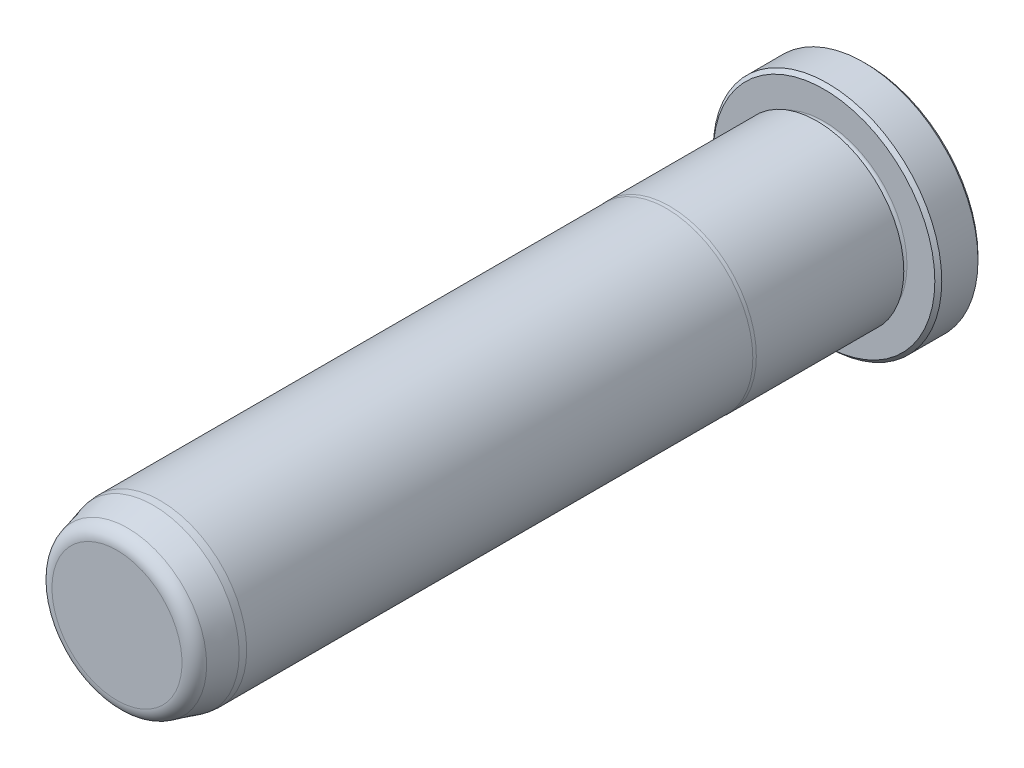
from build123d import *

# Parameters (mm, degrees)
FILLET6_R     = 1.5875
CHAMFER1_SIZE = 0.381


with BuildPart() as part:
    # Sketch1 → Revolve1 (revolve)
    with BuildSketch(Plane(origin=(0, 0, 0), x_dir=(0, 0, -1), z_dir=(1, 0, 0)), mode=Mode.PRIVATE) as revolve1_sk:
        with BuildLine():
            Line((0, 0), (0, 12.573))
            Line((0, 12.573), (-4.7498, 12.573))
            Line((-4.7498, 12.573), (-4.7498, 9.1313))
            ThreePointArc((-4.7498, 9.1313), (-5.1308, 8.7503), (-5.5118, 9.1313))
            Line((-5.5118, 9.1313), (-5.5118, 9.5377))
            Line((-5.5118, 9.5377), (-21.734763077, 9.5377))
            Line((-21.734763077, 9.5377), (-22.098, 9.5123))
            Line((-22.098, 9.5123), (-77.7875, 9.5123))
            Line((-77.7875, 9.5123), (-78.5495, 9.445633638))
            Line((-78.5495, 9.445633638), (-82.55, 8.373702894))
            Line((-82.55, 8.373702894), (-82.55, 0))
            Line((-82.55, 0), (0, 0))
        make_face()
    revolve(revolve1_sk.sketch.rotate(Axis((0, 0, 0), (0, 0, -1)), 90), axis=Axis((0, 0, 0), (0, 0, -1)))

    # Fillet6
    fillet6_edges = [part.edges().sort_by_distance(p)[0] for p in [
        (-8.373702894, 0, 82.55),
    ]]
    fillet(fillet6_edges, radius=FILLET6_R)

    # Chamfer1
    chamfer1_edges = [part.edges().sort_by_distance(p)[0] for p in [
        (-12.573, 0, 4.7498),
        (-12.573, 0, 0),
    ]]
    chamfer(chamfer1_edges, length=CHAMFER1_SIZE)


solid = part.part
